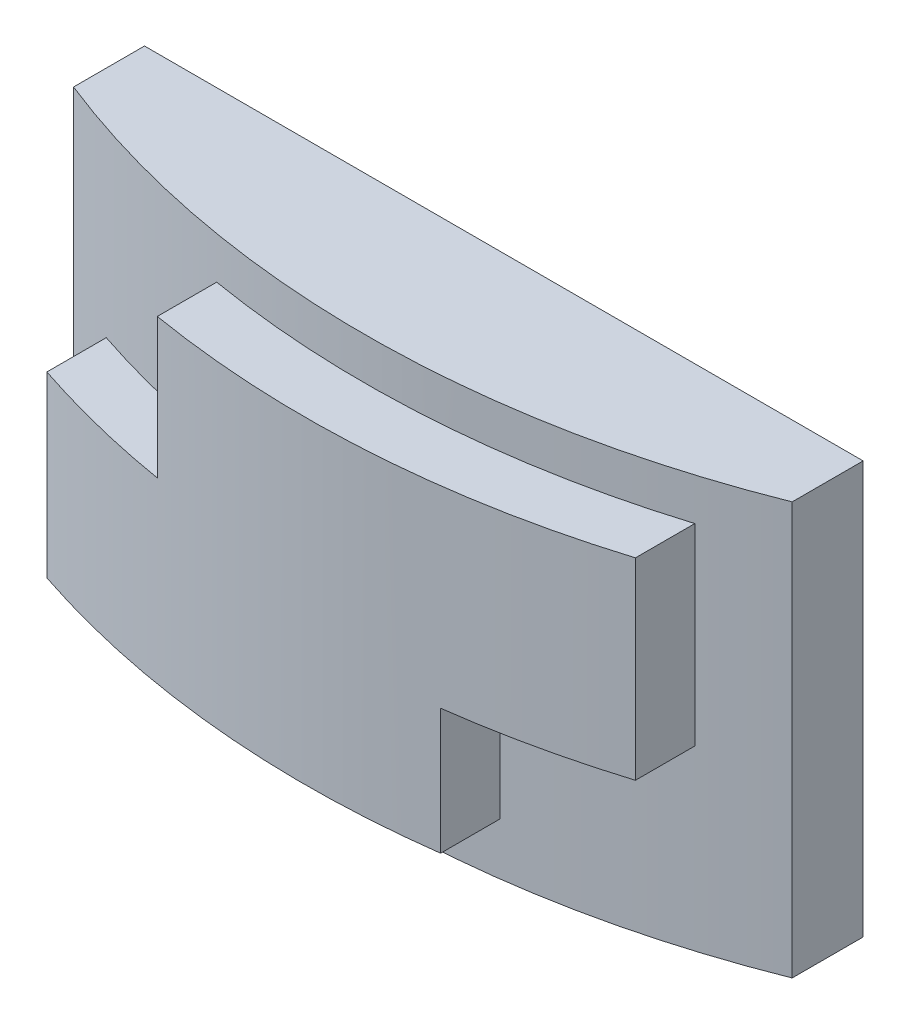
from build123d import *

# Parameters (mm, degrees)
EXTRUDE2_DEPTH             = 69.442801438
BOSS_EXTRUDE1_REACH        = 144.065
BOSS_EXTRUDE1_START_RADIUS = 163.850701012
BOSS_EXTRUDE1_END_RADIUS   = 163.850701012


with BuildPart() as part:
    # Sketch2 → Extrude2 (new body)
    with BuildSketch(Plane(origin=(0, 0, 0), x_dir=(1, 0, 0), z_dir=(0, 1, 0))):
        with BuildLine():
            Line((-59.391176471, 0), (-59.391176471, 11.952941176))
            Line((-59.391176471, 11.952941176), (61.632352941, 11.952941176))
            Line((61.632352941, 11.952941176), (61.632352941, 0))
            ThreePointArc((61.632352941, 0), (1.120588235, -11.583243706), (-59.391176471, 0))
        make_face()
    extrude(amount=EXTRUDE2_DEPTH)

    # Boss-Extrude1: from a cylinder face, 144.065 long prism both ways, kept between that surface and its translate by the depth
    boss_extrude1_start = Plane(origin=(1.120588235, 35.671659, -152.267457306), z_dir=(0, -1, 0)) * Cylinder(BOSS_EXTRUDE1_START_RADIUS, 616.831402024, mode=Mode.PRIVATE)
    boss_extrude1_end = Plane(origin=(1.120588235, 35.671659, -142.267457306), z_dir=(0, -1, 0)) * Cylinder(BOSS_EXTRUDE1_END_RADIUS, 616.831402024, mode=Mode.PRIVATE)
    # Sketch3 → Boss-Extrude1 (add, from a surface)
    with BuildSketch(Plane.XY.offset(-82.33264686), mode=Mode.PRIVATE) as boss_extrude1_sk1:
        Polygon((22.592394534, 8.760022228), (22.592394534, 29.910349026), (49.510992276, 29.910349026), (49.510992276, 62.35687309), (-25.957219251, 62.35687309), (-25.957219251, 38.803100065), (-50.712715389, 38.803100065), (-50.712715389, 8.760022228), align=None)
    boss_extrude1_tool1 = extrude(boss_extrude1_sk1.sketch, amount=BOSS_EXTRUDE1_REACH, both=True, mode=Mode.PRIVATE)
    add(((boss_extrude1_tool1 - boss_extrude1_start) & boss_extrude1_end).solids().sort_by_distance((-0.331965, 35.671659, 11.669421))[0])


solid = part.part
